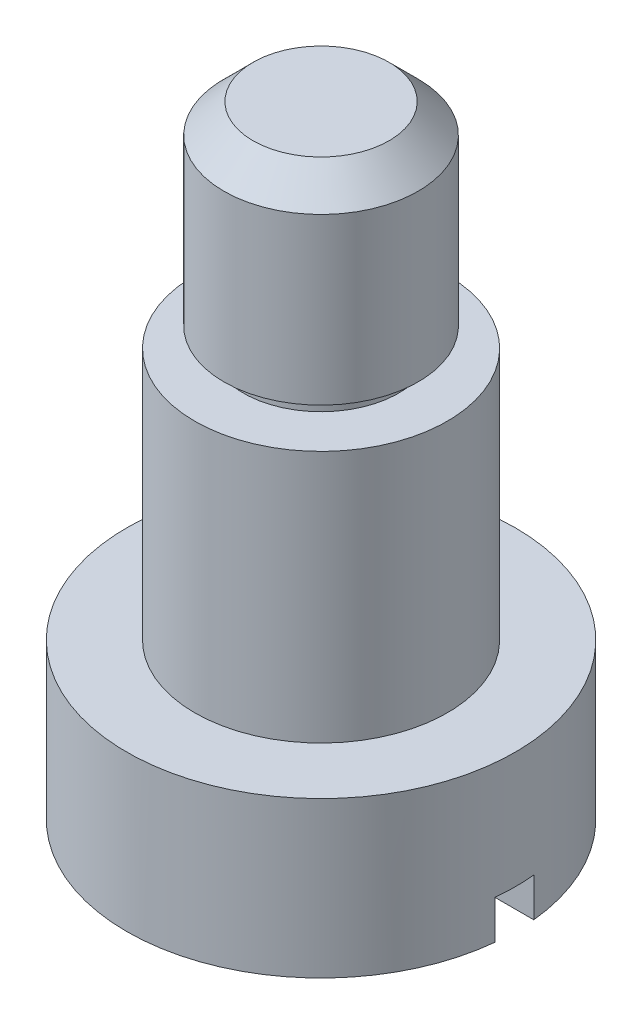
from build123d import *

# Parameters (mm, degrees)
CHANFREIN1_SIZE         = 1.5
ENL_V_MAT_EXTRU_1_DEPTH = 2


with BuildPart() as part:
    # Esquisse1 → Base-R_volution (revolve)
    with BuildSketch(Plane.XY, mode=Mode.PRIVATE) as base_r_volution_sk:
        Polygon((0, 32), (5, 32), (5, 22), (4, 22), (4, 21), (6.5, 21), (6.5, 8), (10, 8), (10, 0), (0, 0), align=None)
    revolve(base_r_volution_sk.sketch.rotate(Axis((0, -26, 0), (0, 1, 0)), 90), axis=Axis((0, -26, 0), (0, 1, 0)))

    # Chanfrein1
    chanfrein1_edges = [part.edges().sort_by_distance(p)[0] for p in [
        (0, 32, 5),
    ]]
    chamfer(chanfrein1_edges, length=CHANFREIN1_SIZE)

    # Esquisse2 → Enl_v. mat.-Extru.1 (cut)
    with BuildSketch(Plane.XZ):
        with BuildLine():
            Line((9.949874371, -1), (-9.949874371, -1))
            ThreePointArc((-9.949874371, -1), (-10, 0), (-9.949874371, 1))
            Line((-9.949874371, 1), (9.949874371, 1))
            ThreePointArc((9.949874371, 1), (10, 0), (9.949874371, -1))
        make_face()
    extrude(amount=-ENL_V_MAT_EXTRU_1_DEPTH, mode=Mode.SUBTRACT)


solid = part.part
